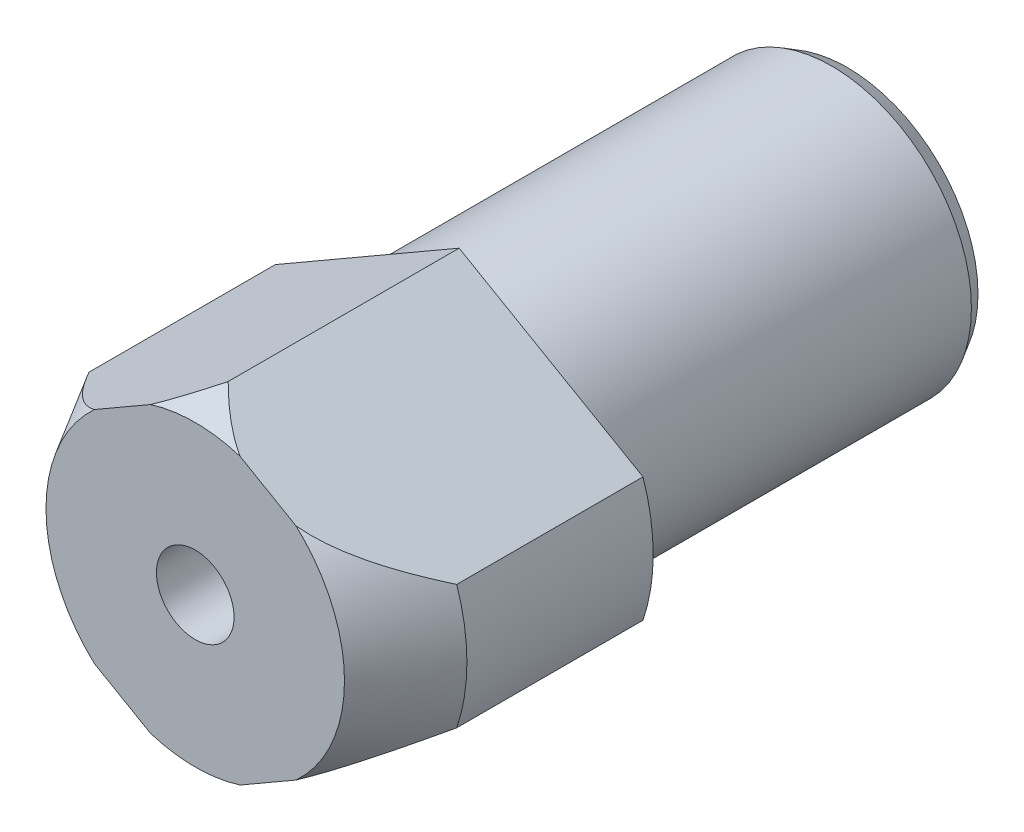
ISO-10303-21;
HEADER;
FILE_DESCRIPTION(('STEP AP214'),'2;1');
FILE_NAME('part.step','',(''),(''),'','','');
FILE_SCHEMA(('AUTOMOTIVE_DESIGN { 1 0 10303 214 1 1 1 1 }'));
ENDSEC;
DATA;
#1=APPLICATION_CONTEXT('core data for automotive mechanical design processes');
#2=APPLICATION_PROTOCOL_DEFINITION('international standard','automotive_design',2000,#1);
#3=PRODUCT_CONTEXT('',#1,'mechanical');
#4=PRODUCT('Part','Part','',(#3));
#5=PRODUCT_RELATED_PRODUCT_CATEGORY('part','',(#4));
#6=PRODUCT_DEFINITION_FORMATION('','',#4);
#7=PRODUCT_DEFINITION_CONTEXT('part definition',#1,'design');
#8=PRODUCT_DEFINITION('design','',#6,#7);
#9=PRODUCT_DEFINITION_SHAPE('','',#8);
#10=(LENGTH_UNIT() NAMED_UNIT(*) SI_UNIT(.MILLI.,.METRE.));
#11=(NAMED_UNIT(*) PLANE_ANGLE_UNIT() SI_UNIT($,.RADIAN.));
#12=(NAMED_UNIT(*) SI_UNIT($,.STERADIAN.) SOLID_ANGLE_UNIT());
#13=UNCERTAINTY_MEASURE_WITH_UNIT(LENGTH_MEASURE(1.E-05),#10,'distance_accuracy_value','');
#14=(GEOMETRIC_REPRESENTATION_CONTEXT(3) GLOBAL_UNCERTAINTY_ASSIGNED_CONTEXT((#13)) GLOBAL_UNIT_ASSIGNED_CONTEXT((#10,
#11,#12)) REPRESENTATION_CONTEXT('',''));
#15=CARTESIAN_POINT('',(0.,0.,0.));
#16=DIRECTION('',(0.,0.,1.));
#17=DIRECTION('',(1.,0.,0.));
#18=AXIS2_PLACEMENT_3D('',#15,#16,#17);
#19=CARTESIAN_POINT('',(0.,0.,12.));
#20=DIRECTION('',(0.,0.,-1.));
#21=DIRECTION('',(-1.,0.,0.));
#22=AXIS2_PLACEMENT_3D('',#19,#20,#21);
#23=CONICAL_SURFACE('',#22,12.5,0.523598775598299);
#24=CARTESIAN_POINT('',(6.49386498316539,7.08816246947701,17.0002));
#25=CARTESIAN_POINT('',(6.60533670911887,7.02380423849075,16.9519658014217));
#26=CARTESIAN_POINT('',(6.71554975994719,6.96017270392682,16.9000110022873));
#27=CARTESIAN_POINT('',(6.93338196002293,6.83440722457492,16.7894856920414));
#28=CARTESIAN_POINT('',(7.04100270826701,6.77227235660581,16.7309193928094));
#29=CARTESIAN_POINT('',(7.35935904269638,6.58846924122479,16.5468522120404));
#30=CARTESIAN_POINT('',(7.5663346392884,6.46897182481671,16.4126495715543));
#31=CARTESIAN_POINT('',(7.96833081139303,6.2368792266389,16.128105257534));
#32=CARTESIAN_POINT('',(8.16346186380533,6.12422026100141,15.9779679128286));
#33=CARTESIAN_POINT('',(8.54554525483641,5.90362431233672,15.6640833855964));
#34=CARTESIAN_POINT('',(8.73248971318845,5.79569187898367,15.5003235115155));
#35=CARTESIAN_POINT('',(9.1814473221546,5.53648608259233,15.0863652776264));
#36=CARTESIAN_POINT('',(9.43944719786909,5.38752978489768,14.830390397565));
#37=CARTESIAN_POINT('',(9.94306507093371,5.09676587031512,14.3027424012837));
#38=CARTESIAN_POINT('',(10.1886801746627,4.95495992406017,14.0310656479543));
#39=CARTESIAN_POINT('',(10.5517027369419,4.74536875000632,13.6123948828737));
#40=CARTESIAN_POINT('',(10.6728467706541,4.67542620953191,13.4696780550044));
#41=CARTESIAN_POINT('',(10.912788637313,4.53689570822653,13.181627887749));
#42=CARTESIAN_POINT('',(11.0315864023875,4.46830778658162,13.0362944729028));
#43=CARTESIAN_POINT('',(11.2669028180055,4.33244779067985,12.7435624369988));
#44=CARTESIAN_POINT('',(11.3834243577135,4.26517404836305,12.5961669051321));
#45=CARTESIAN_POINT('',(11.6145403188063,4.13173918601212,12.2994009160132));
#46=CARTESIAN_POINT('',(11.7291349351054,4.0655779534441,12.150030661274));
#47=CARTESIAN_POINT('',(11.8428706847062,3.99991258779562,11.9998));
#48=B_SPLINE_CURVE_WITH_KNOTS('',3,(#24,#25,#26,#27,#28,#29,#30,#31,#32,#33,#34,#35,#36,#37,#38,
#39,#40,#41,#42,#43,#44,#45,#46,#47),.UNSPECIFIED.,.F.,.F.,(4,2,2,2,2,2,2,2,2,2,2,4),(0.,
0.412226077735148,0.824191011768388,1.64536256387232,2.45704872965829,3.26949976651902,
4.44701188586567,5.62479786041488,6.224288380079,6.8237962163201,7.42248587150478,
8.02111459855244),.UNSPECIFIED.);
#49=CARTESIAN_POINT('',(6.49432714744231,7.08789563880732,17.));
#50=VERTEX_POINT('',#49);
#51=CARTESIAN_POINT('',(11.842719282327,4.,12.));
#52=VERTEX_POINT('',#51);
#53=EDGE_CURVE('E99',#50,#52,#48,.T.);
#54=ORIENTED_EDGE('',*,*,#53,.F.);
#55=CARTESIAN_POINT('',(0.,0.,17.));
#56=DIRECTION('',(0.,0.,1.));
#57=DIRECTION('',(1.,0.,0.));
#58=AXIS2_PLACEMENT_3D('',#55,#56,#57);
#59=CIRCLE('',#58,9.61324865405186);
#60=CARTESIAN_POINT('',(6.49432714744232,-7.08789563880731,17.));
#61=VERTEX_POINT('',#60);
#62=EDGE_CURVE('E224',#61,#50,#59,.T.);
#63=ORIENTED_EDGE('',*,*,#62,.F.);
#64=CARTESIAN_POINT('',(6.4938649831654,-7.088162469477,17.0002));
#65=CARTESIAN_POINT('',(6.60533670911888,-7.02380423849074,16.9519658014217));
#66=CARTESIAN_POINT('',(6.7155497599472,-6.96017270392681,16.9000110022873));
#67=CARTESIAN_POINT('',(6.93338196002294,-6.83440722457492,16.7894856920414));
#68=CARTESIAN_POINT('',(7.04100270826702,-6.77227235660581,16.7309193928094));
#69=CARTESIAN_POINT('',(7.35935904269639,-6.58846924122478,16.5468522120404));
#70=CARTESIAN_POINT('',(7.5663346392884,-6.4689718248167,16.4126495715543));
#71=CARTESIAN_POINT('',(7.96833081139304,-6.2368792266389,16.128105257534));
#72=CARTESIAN_POINT('',(8.16346186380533,-6.12422026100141,15.9779679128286));
#73=CARTESIAN_POINT('',(8.54554525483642,-5.90362431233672,15.6640833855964));
#74=CARTESIAN_POINT('',(8.73248971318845,-5.79569187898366,15.5003235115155));
#75=CARTESIAN_POINT('',(9.1814473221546,-5.53648608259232,15.0863652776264));
#76=CARTESIAN_POINT('',(9.43944719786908,-5.38752978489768,14.830390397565));
#77=CARTESIAN_POINT('',(9.94306507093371,-5.09676587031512,14.3027424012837));
#78=CARTESIAN_POINT('',(10.1886801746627,-4.95495992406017,14.0310656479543));
#79=CARTESIAN_POINT('',(10.5517027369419,-4.74536875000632,13.6123948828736));
#80=CARTESIAN_POINT('',(10.6728467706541,-4.67542620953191,13.4696780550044));
#81=CARTESIAN_POINT('',(10.912788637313,-4.53689570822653,13.181627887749));
#82=CARTESIAN_POINT('',(11.0315864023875,-4.46830778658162,13.0362944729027));
#83=CARTESIAN_POINT('',(11.2669028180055,-4.33244779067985,12.7435624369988));
#84=CARTESIAN_POINT('',(11.3834243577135,-4.26517404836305,12.5961669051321));
#85=CARTESIAN_POINT('',(11.6145403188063,-4.13173918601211,12.2994009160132));
#86=CARTESIAN_POINT('',(11.7291349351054,-4.0655779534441,12.150030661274));
#87=CARTESIAN_POINT('',(11.8428706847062,-3.99991258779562,11.9998));
#88=B_SPLINE_CURVE_WITH_KNOTS('',3,(#64,#65,#66,#67,#68,#69,#70,#71,#72,#73,#74,#75,#76,#77,#78,
#79,#80,#81,#82,#83,#84,#85,#86,#87),.UNSPECIFIED.,.F.,.F.,(4,2,2,2,2,2,2,2,2,2,2,4),(0.,
0.412226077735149,0.824191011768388,1.64536256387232,2.45704872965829,3.26949976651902,
4.44701188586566,5.62479786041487,6.224288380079,6.82379621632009,7.42248587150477,
8.02111459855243),.UNSPECIFIED.);
#89=CARTESIAN_POINT('',(11.842719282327,-4.,12.));
#90=VERTEX_POINT('',#89);
#91=EDGE_CURVE('E237',#61,#90,#88,.T.);
#92=ORIENTED_EDGE('',*,*,#91,.T.);
#93=CARTESIAN_POINT('',(0.,0.,12.));
#94=DIRECTION('',(0.,0.,1.));
#95=DIRECTION('',(1.,0.,0.));
#96=AXIS2_PLACEMENT_3D('',#93,#94,#95);
#97=CIRCLE('',#96,12.5);
#98=EDGE_CURVE('E124',#90,#52,#97,.T.);
#99=ORIENTED_EDGE('',*,*,#98,.T.);
#100=EDGE_LOOP('',(#54,#63,#92,#99));
#101=FACE_BOUND('',#100,.T.);
#102=ADVANCED_FACE('F14',(#101),#23,.T.);
#103=CARTESIAN_POINT('',(-0.000200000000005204,10.8375126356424,14.8795125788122));
#104=CARTESIAN_POINT('',(0.10853087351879,10.7747368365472,14.9882268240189));
#105=CARTESIAN_POINT('',(0.218469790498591,10.7112635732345,15.0953542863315));
#106=CARTESIAN_POINT('',(0.441035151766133,10.5827654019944,15.3058908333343));
#107=CARTESIAN_POINT('',(0.553662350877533,10.5177400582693,15.4092988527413));
#108=CARTESIAN_POINT('',(0.780942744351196,10.3865196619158,15.6110158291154));
#109=CARTESIAN_POINT('',(0.895573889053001,10.3203373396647,15.7093577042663));
#110=CARTESIAN_POINT('',(1.12790669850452,10.1861999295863,15.9010504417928));
#111=CARTESIAN_POINT('',(1.24560839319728,10.1182448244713,15.9944012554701));
#112=CARTESIAN_POINT('',(1.60419684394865,9.91121368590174,16.2661456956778));
#113=CARTESIAN_POINT('',(1.85018375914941,9.76919307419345,16.4358843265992));
#114=CARTESIAN_POINT('',(2.23101578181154,9.54931960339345,16.6670579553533));
#115=CARTESIAN_POINT('',(2.36044638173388,9.47459281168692,16.740442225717));
#116=CARTESIAN_POINT('',(2.62315549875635,9.32291763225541,16.8777749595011));
#117=CARTESIAN_POINT('',(2.75643779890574,9.24596706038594,16.9417137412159));
#118=CARTESIAN_POINT('',(2.89159627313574,9.16793327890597,17.0002));
#119=B_SPLINE_CURVE_WITH_KNOTS('',3,(#103,#104,#105,#106,#107,#108,#109,#110,#111,#112,#113,
#114,#115,#116,#117,#118),.UNSPECIFIED.,.F.,.F.,(4,2,2,2,2,2,2,4),(0.,0.498243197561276,
0.996627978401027,1.49120549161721,1.9857878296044,2.97663541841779,3.47584274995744,
3.97555827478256),.UNSPECIFIED.);
#120=CARTESIAN_POINT('',(0.,10.8373971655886,14.8797125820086));
#121=VERTEX_POINT('',#120);
#122=CARTESIAN_POINT('',(2.89113410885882,9.16820010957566,17.));
#123=VERTEX_POINT('',#122);
#124=EDGE_CURVE('E229',#121,#123,#119,.T.);
#125=ORIENTED_EDGE('',*,*,#124,.F.);
#126=CARTESIAN_POINT('',(0.000199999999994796,10.8375126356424,14.8795125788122));
#127=CARTESIAN_POINT('',(-0.1085308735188,10.7747368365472,14.9882268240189));
#128=CARTESIAN_POINT('',(-0.218469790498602,10.7112635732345,15.0953542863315));
#129=CARTESIAN_POINT('',(-0.441035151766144,10.5827654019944,15.3058908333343));
#130=CARTESIAN_POINT('',(-0.553662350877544,10.5177400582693,15.4092988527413));
#131=CARTESIAN_POINT('',(-0.780942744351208,10.3865196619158,15.6110158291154));
#132=CARTESIAN_POINT('',(-0.895573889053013,10.3203373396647,15.7093577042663));
#133=CARTESIAN_POINT('',(-1.12790669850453,10.1861999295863,15.9010504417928));
#134=CARTESIAN_POINT('',(-1.24560839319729,10.1182448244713,15.9944012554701));
#135=CARTESIAN_POINT('',(-1.60419684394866,9.91121368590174,16.2661456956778));
#136=CARTESIAN_POINT('',(-1.85018375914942,9.76919307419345,16.4358843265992));
#137=CARTESIAN_POINT('',(-2.23101578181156,9.54931960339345,16.6670579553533));
#138=CARTESIAN_POINT('',(-2.36044638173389,9.47459281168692,16.740442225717));
#139=CARTESIAN_POINT('',(-2.62315549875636,9.32291763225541,16.8777749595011));
#140=CARTESIAN_POINT('',(-2.75643779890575,9.24596706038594,16.9417137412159));
#141=CARTESIAN_POINT('',(-2.89159627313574,9.16793327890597,17.0002));
#142=B_SPLINE_CURVE_WITH_KNOTS('',3,(#126,#127,#128,#129,#130,#131,#132,#133,#134,#135,#136,
#137,#138,#139,#140,#141),.UNSPECIFIED.,.F.,.F.,(4,2,2,2,2,2,2,4),(0.,0.498243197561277,
0.996627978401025,1.49120549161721,1.9857878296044,2.97663541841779,3.47584274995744,
3.97555827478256),.UNSPECIFIED.);
#143=CARTESIAN_POINT('',(-2.89113410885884,9.16820010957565,17.));
#144=VERTEX_POINT('',#143);
#145=EDGE_CURVE('E104',#121,#144,#142,.T.);
#146=ORIENTED_EDGE('',*,*,#145,.T.);
#147=EDGE_CURVE('E221',#123,#144,#59,.T.);
#148=ORIENTED_EDGE('',*,*,#147,.F.);
#149=EDGE_LOOP('',(#125,#146,#148));
#150=FACE_BOUND('',#149,.T.);
#151=ADVANCED_FACE('F151',(#150),#23,.T.);
#152=CARTESIAN_POINT('',(9.61324865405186,0.,17.));
#153=DIRECTION('',(0.,0.,-1.));
#154=DIRECTION('',(-1.,0.,0.));
#155=AXIS2_PLACEMENT_3D('',#152,#153,#154);
#156=PLANE('',#155);
#157=CARTESIAN_POINT('',(0.,0.,17.));
#158=DIRECTION('',(0.,0.,1.));
#159=DIRECTION('',(1.,0.,0.));
#160=AXIS2_PLACEMENT_3D('',#157,#158,#159);
#161=CIRCLE('',#160,2.5);
#162=CARTESIAN_POINT('',(2.5,0.,17.));
#163=VERTEX_POINT('',#162);
#164=EDGE_CURVE('E214',#163,#163,#161,.T.);
#165=ORIENTED_EDGE('',*,*,#164,.F.);
#166=EDGE_LOOP('',(#165));
#167=FACE_BOUND('',#166,.T.);
#168=DIRECTION('',(-0.866025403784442,0.5,0.));
#169=VECTOR('',#168,1.);
#170=CARTESIAN_POINT('',(11.842719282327,4.,17.));
#171=LINE('',#170,#169);
#172=EDGE_CURVE('E218',#50,#123,#171,.T.);
#173=ORIENTED_EDGE('',*,*,#172,.T.);
#174=ORIENTED_EDGE('',*,*,#147,.T.);
#175=DIRECTION('',(0.866025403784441,0.5,0.));
#176=VECTOR('',#175,1.);
#177=CARTESIAN_POINT('',(-11.842719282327,4.,17.));
#178=LINE('',#177,#176);
#179=CARTESIAN_POINT('',(-6.49432714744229,7.08789563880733,17.));
#180=VERTEX_POINT('',#179);
#181=EDGE_CURVE('E113',#180,#144,#178,.T.);
#182=ORIENTED_EDGE('',*,*,#181,.F.);
#183=CARTESIAN_POINT('',(-6.4943271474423,-7.08789563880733,17.));
#184=VERTEX_POINT('',#183);
#185=EDGE_CURVE('E230',#180,#184,#59,.T.);
#186=ORIENTED_EDGE('',*,*,#185,.T.);
#187=DIRECTION('',(0.866025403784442,-0.5,0.));
#188=VECTOR('',#187,1.);
#189=CARTESIAN_POINT('',(-11.842719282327,-4.,17.));
#190=LINE('',#189,#188);
#191=CARTESIAN_POINT('',(-2.89113410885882,-9.16820010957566,17.));
#192=VERTEX_POINT('',#191);
#193=EDGE_CURVE('E251',#184,#192,#190,.T.);
#194=ORIENTED_EDGE('',*,*,#193,.T.);
#195=CARTESIAN_POINT('',(2.89113410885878,-9.16820010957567,17.));
#196=VERTEX_POINT('',#195);
#197=EDGE_CURVE('E179',#192,#196,#59,.T.);
#198=ORIENTED_EDGE('',*,*,#197,.T.);
#199=DIRECTION('',(-0.866025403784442,-0.5,0.));
#200=VECTOR('',#199,1.);
#201=CARTESIAN_POINT('',(11.842719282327,-4.,17.));
#202=LINE('',#201,#200);
#203=EDGE_CURVE('E249',#61,#196,#202,.T.);
#204=ORIENTED_EDGE('',*,*,#203,.F.);
#205=ORIENTED_EDGE('',*,*,#62,.T.);
#206=EDGE_LOOP('',(#173,#174,#182,#186,#194,#198,#204,#205));
#207=FACE_BOUND('',#206,.T.);
#208=ADVANCED_FACE('F157',(#167,#207),#156,.F.);
#209=CARTESIAN_POINT('',(9.,0.,0.));
#210=DIRECTION('',(0.,0.,1.));
#211=DIRECTION('',(1.,0.,0.));
#212=AXIS2_PLACEMENT_3D('',#209,#210,#211);
#213=PLANE('',#212);
#214=CARTESIAN_POINT('',(0.,0.,0.));
#215=DIRECTION('',(0.,0.,1.));
#216=DIRECTION('',(1.,0.,0.));
#217=AXIS2_PLACEMENT_3D('',#214,#215,#216);
#218=CIRCLE('',#217,9.);
#219=CARTESIAN_POINT('',(9.,0.,0.));
#220=VERTEX_POINT('',#219);
#221=EDGE_CURVE('E118',#220,#220,#218,.T.);
#222=ORIENTED_EDGE('',*,*,#221,.T.);
#223=EDGE_LOOP('',(#222));
#224=FACE_BOUND('',#223,.T.);
#225=DIRECTION('',(-0.866025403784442,0.5,0.));
#226=VECTOR('',#225,1.);
#227=CARTESIAN_POINT('',(11.842719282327,4.,0.));
#228=LINE('',#227,#226);
#229=CARTESIAN_POINT('',(11.842719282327,4.,0.));
#230=VERTEX_POINT('',#229);
#231=CARTESIAN_POINT('',(0.,10.8373971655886,0.));
#232=VERTEX_POINT('',#231);
#233=EDGE_CURVE('E97',#230,#232,#228,.T.);
#234=ORIENTED_EDGE('',*,*,#233,.F.);
#235=CARTESIAN_POINT('',(0.,0.,0.));
#236=DIRECTION('',(0.,0.,1.));
#237=DIRECTION('',(1.,0.,0.));
#238=AXIS2_PLACEMENT_3D('',#235,#236,#237);
#239=CIRCLE('',#238,12.5);
#240=CARTESIAN_POINT('',(11.842719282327,-4.,0.));
#241=VERTEX_POINT('',#240);
#242=EDGE_CURVE('E111',#241,#230,#239,.T.);
#243=ORIENTED_EDGE('',*,*,#242,.F.);
#244=DIRECTION('',(-0.866025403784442,-0.5,0.));
#245=VECTOR('',#244,1.);
#246=CARTESIAN_POINT('',(11.842719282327,-4.,0.));
#247=LINE('',#246,#245);
#248=CARTESIAN_POINT('',(0.,-10.8373971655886,0.));
#249=VERTEX_POINT('',#248);
#250=EDGE_CURVE('E254',#241,#249,#247,.T.);
#251=ORIENTED_EDGE('',*,*,#250,.T.);
#252=DIRECTION('',(0.866025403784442,-0.5,0.));
#253=VECTOR('',#252,1.);
#254=CARTESIAN_POINT('',(-11.842719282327,-4.,0.));
#255=LINE('',#254,#253);
#256=CARTESIAN_POINT('',(-11.842719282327,-4.,0.));
#257=VERTEX_POINT('',#256);
#258=EDGE_CURVE('E250',#257,#249,#255,.T.);
#259=ORIENTED_EDGE('',*,*,#258,.F.);
#260=CARTESIAN_POINT('',(-11.842719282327,4.,0.));
#261=VERTEX_POINT('',#260);
#262=EDGE_CURVE('E119',#261,#257,#239,.T.);
#263=ORIENTED_EDGE('',*,*,#262,.F.);
#264=DIRECTION('',(0.866025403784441,0.5,0.));
#265=VECTOR('',#264,1.);
#266=CARTESIAN_POINT('',(-11.842719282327,4.,0.));
#267=LINE('',#266,#265);
#268=EDGE_CURVE('E29',#261,#232,#267,.T.);
#269=ORIENTED_EDGE('',*,*,#268,.T.);
#270=EDGE_LOOP('',(#234,#243,#251,#259,#263,#269));
#271=FACE_BOUND('',#270,.T.);
#272=ADVANCED_FACE('F109',(#224,#271),#213,.F.);
#273=CARTESIAN_POINT('',(0.,0.,30.));
#274=DIRECTION('',(0.,0.,1.));
#275=DIRECTION('',(1.,0.,0.));
#276=AXIS2_PLACEMENT_3D('',#273,#274,#275);
#277=CYLINDRICAL_SURFACE('',#276,12.5);
#278=DIRECTION('',(0.,0.,1.));
#279=VECTOR('',#278,1.);
#280=CARTESIAN_POINT('',(11.842719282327,4.,0.));
#281=LINE('',#280,#279);
#282=EDGE_CURVE('E93',#230,#52,#281,.T.);
#283=ORIENTED_EDGE('',*,*,#282,.T.);
#284=ORIENTED_EDGE('',*,*,#98,.F.);
#285=DIRECTION('',(0.,0.,1.));
#286=VECTOR('',#285,1.);
#287=CARTESIAN_POINT('',(11.842719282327,-4.,0.));
#288=LINE('',#287,#286);
#289=EDGE_CURVE('E117',#241,#90,#288,.T.);
#290=ORIENTED_EDGE('',*,*,#289,.F.);
#291=ORIENTED_EDGE('',*,*,#242,.T.);
#292=EDGE_LOOP('',(#283,#284,#290,#291));
#293=FACE_BOUND('',#292,.T.);
#294=ADVANCED_FACE('F116',(#293),#277,.T.);
#295=ORIENTED_EDGE('',*,*,#185,.F.);
#296=CARTESIAN_POINT('',(-6.49386498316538,7.08816246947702,17.0002));
#297=CARTESIAN_POINT('',(-6.60533670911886,7.02380423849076,16.9519658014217));
#298=CARTESIAN_POINT('',(-6.71554975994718,6.96017270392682,16.9000110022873));
#299=CARTESIAN_POINT('',(-6.93338196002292,6.83440722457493,16.7894856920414));
#300=CARTESIAN_POINT('',(-7.04100270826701,6.77227235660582,16.7309193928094));
#301=CARTESIAN_POINT('',(-7.35935904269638,6.5884692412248,16.5468522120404));
#302=CARTESIAN_POINT('',(-7.56633463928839,6.46897182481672,16.4126495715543));
#303=CARTESIAN_POINT('',(-7.96833081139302,6.23687922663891,16.128105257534));
#304=CARTESIAN_POINT('',(-8.16346186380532,6.12422026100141,15.9779679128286));
#305=CARTESIAN_POINT('',(-8.54554525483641,5.90362431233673,15.6640833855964));
#306=CARTESIAN_POINT('',(-8.73248971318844,5.79569187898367,15.5003235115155));
#307=CARTESIAN_POINT('',(-9.18144732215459,5.53648608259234,15.0863652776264));
#308=CARTESIAN_POINT('',(-9.43944719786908,5.38752978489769,14.830390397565));
#309=CARTESIAN_POINT('',(-9.94306507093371,5.09676587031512,14.3027424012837));
#310=CARTESIAN_POINT('',(-10.1886801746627,4.95495992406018,14.0310656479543));
#311=CARTESIAN_POINT('',(-10.5517027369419,4.74536875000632,13.6123948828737));
#312=CARTESIAN_POINT('',(-10.6728467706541,4.67542620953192,13.4696780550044));
#313=CARTESIAN_POINT('',(-10.912788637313,4.53689570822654,13.181627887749));
#314=CARTESIAN_POINT('',(-11.0315864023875,4.46830778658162,13.0362944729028));
#315=CARTESIAN_POINT('',(-11.2669028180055,4.33244779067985,12.7435624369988));
#316=CARTESIAN_POINT('',(-11.3834243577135,4.26517404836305,12.5961669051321));
#317=CARTESIAN_POINT('',(-11.6145403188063,4.13173918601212,12.2994009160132));
#318=CARTESIAN_POINT('',(-11.7291349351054,4.0655779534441,12.150030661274));
#319=CARTESIAN_POINT('',(-11.8428706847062,3.99991258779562,11.9998));
#320=B_SPLINE_CURVE_WITH_KNOTS('',3,(#296,#297,#298,#299,#300,#301,#302,#303,#304,#305,#306,
#307,#308,#309,#310,#311,#312,#313,#314,#315,#316,#317,#318,#319),.UNSPECIFIED.,.F.,.F.,(4,2,2,
2,2,2,2,2,2,2,2,4),(0.,0.41222607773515,0.824191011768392,1.64536256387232,2.4570487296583,
3.26949976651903,4.44701188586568,5.62479786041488,6.22428838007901,6.82379621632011,
7.42248587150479,8.02111459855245),.UNSPECIFIED.);
#321=CARTESIAN_POINT('',(-11.842719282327,4.,12.));
#322=VERTEX_POINT('',#321);
#323=EDGE_CURVE('E270',#180,#322,#320,.T.);
#324=ORIENTED_EDGE('',*,*,#323,.T.);
#325=CARTESIAN_POINT('',(-11.842719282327,-4.,12.));
#326=VERTEX_POINT('',#325);
#327=EDGE_CURVE('E232',#322,#326,#97,.T.);
#328=ORIENTED_EDGE('',*,*,#327,.T.);
#329=CARTESIAN_POINT('',(-6.49386498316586,-7.08816246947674,17.0002));
#330=CARTESIAN_POINT('',(-6.6053367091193,-7.0238042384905,16.9519658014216));
#331=CARTESIAN_POINT('',(-6.7155497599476,-6.96017270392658,16.9000110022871));
#332=CARTESIAN_POINT('',(-6.93338196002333,-6.83440722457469,16.7894856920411));
#333=CARTESIAN_POINT('',(-7.04100270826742,-6.77227235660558,16.7309193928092));
#334=CARTESIAN_POINT('',(-7.35935904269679,-6.58846924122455,16.5468522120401));
#335=CARTESIAN_POINT('',(-7.5663346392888,-6.46897182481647,16.412649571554));
#336=CARTESIAN_POINT('',(-7.96833081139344,-6.23687922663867,16.1281052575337));
#337=CARTESIAN_POINT('',(-8.16346186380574,-6.12422026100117,15.9779679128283));
#338=CARTESIAN_POINT('',(-8.54554525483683,-5.90362431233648,15.664083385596));
#339=CARTESIAN_POINT('',(-8.73248971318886,-5.79569187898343,15.5003235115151));
#340=CARTESIAN_POINT('',(-9.18144732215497,-5.53648608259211,15.0863652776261));
#341=CARTESIAN_POINT('',(-9.43944719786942,-5.38752978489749,14.8303903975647));
#342=CARTESIAN_POINT('',(-9.94306507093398,-5.09676587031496,14.3027424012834));
#343=CARTESIAN_POINT('',(-10.1886801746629,-4.95495992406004,14.031065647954));
#344=CARTESIAN_POINT('',(-10.5517027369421,-4.74536875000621,13.6123948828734));
#345=CARTESIAN_POINT('',(-10.6728467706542,-4.67542620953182,13.4696780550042));
#346=CARTESIAN_POINT('',(-10.9127886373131,-4.53689570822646,13.1816278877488));
#347=CARTESIAN_POINT('',(-11.0315864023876,-4.46830778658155,13.0362944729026));
#348=CARTESIAN_POINT('',(-11.2669028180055,-4.33244779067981,12.7435624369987));
#349=CARTESIAN_POINT('',(-11.3834243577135,-4.26517404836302,12.596166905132));
#350=CARTESIAN_POINT('',(-11.6145403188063,-4.1317391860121,12.2994009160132));
#351=CARTESIAN_POINT('',(-11.7291349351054,-4.06557795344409,12.150030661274));
#352=CARTESIAN_POINT('',(-11.8428706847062,-3.99991258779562,11.9998));
#353=B_SPLINE_CURVE_WITH_KNOTS('',3,(#329,#330,#331,#332,#333,#334,#335,#336,#337,#338,#339,
#340,#341,#342,#343,#344,#345,#346,#347,#348,#349,#350,#351,#352),.UNSPECIFIED.,.F.,.F.,(4,2,2,
2,2,2,2,2,2,2,2,4),(0.,0.412226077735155,0.824191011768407,1.64536256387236,2.45704872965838,
3.26949976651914,4.44701188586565,5.62479786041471,6.22428838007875,6.82379621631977,
7.42248587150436,8.02111459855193),.UNSPECIFIED.);
#354=EDGE_CURVE('E180',#184,#326,#353,.T.);
#355=ORIENTED_EDGE('',*,*,#354,.F.);
#356=EDGE_LOOP('',(#295,#324,#328,#355));
#357=FACE_BOUND('',#356,.T.);
#358=ADVANCED_FACE('F143',(#357),#23,.T.);
#359=CARTESIAN_POINT('',(0.,0.,-21.));
#360=DIRECTION('',(0.,0.,1.));
#361=DIRECTION('',(1.,0.,0.));
#362=AXIS2_PLACEMENT_3D('',#359,#360,#361);
#363=PLANE('',#362);
#364=CARTESIAN_POINT('',(0.,0.,-21.));
#365=DIRECTION('',(0.,0.,1.));
#366=DIRECTION('',(1.,0.,0.));
#367=AXIS2_PLACEMENT_3D('',#364,#365,#366);
#368=CIRCLE('',#367,1.);
#369=CARTESIAN_POINT('',(1.,0.,-21.));
#370=VERTEX_POINT('',#369);
#371=EDGE_CURVE('E9',#370,#370,#368,.T.);
#372=ORIENTED_EDGE('',*,*,#371,.F.);
#373=EDGE_LOOP('',(#372));
#374=FACE_BOUND('',#373,.T.);
#375=ADVANCED_FACE('F16',(#374),#363,.F.);
#376=CARTESIAN_POINT('',(0.,0.,30.));
#377=DIRECTION('',(0.,0.,1.));
#378=DIRECTION('',(1.,0.,0.));
#379=AXIS2_PLACEMENT_3D('',#376,#377,#378);
#380=CYLINDRICAL_SURFACE('',#379,1.);
#381=CARTESIAN_POINT('',(0.,0.,-25.));
#382=DIRECTION('',(0.,0.,1.));
#383=DIRECTION('',(1.,0.,0.));
#384=AXIS2_PLACEMENT_3D('',#381,#382,#383);
#385=CIRCLE('',#384,1.);
#386=CARTESIAN_POINT('',(1.,0.,-25.));
#387=VERTEX_POINT('',#386);
#388=EDGE_CURVE('E22',#387,#387,#385,.T.);
#389=ORIENTED_EDGE('',*,*,#388,.F.);
#390=EDGE_LOOP('',(#389));
#391=FACE_BOUND('',#390,.T.);
#392=ORIENTED_EDGE('',*,*,#371,.T.);
#393=EDGE_LOOP('',(#392));
#394=FACE_BOUND('',#393,.T.);
#395=ADVANCED_FACE('F137',(#391,#394),#380,.F.);
#396=CARTESIAN_POINT('',(1.,0.,-25.));
#397=DIRECTION('',(0.,0.,1.));
#398=DIRECTION('',(1.,0.,0.));
#399=AXIS2_PLACEMENT_3D('',#396,#397,#398);
#400=PLANE('',#399);
#401=CARTESIAN_POINT('',(0.,0.,-25.));
#402=DIRECTION('',(0.,0.,1.));
#403=DIRECTION('',(1.,0.,0.));
#404=AXIS2_PLACEMENT_3D('',#401,#402,#403);
#405=CIRCLE('',#404,8.42264973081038);
#406=CARTESIAN_POINT('',(8.42264973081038,0.,-25.));
#407=VERTEX_POINT('',#406);
#408=EDGE_CURVE('E130',#407,#407,#405,.T.);
#409=ORIENTED_EDGE('',*,*,#408,.F.);
#410=EDGE_LOOP('',(#409));
#411=FACE_BOUND('',#410,.T.);
#412=ORIENTED_EDGE('',*,*,#388,.T.);
#413=EDGE_LOOP('',(#412));
#414=FACE_BOUND('',#413,.T.);
#415=ADVANCED_FACE('F135',(#411,#414),#400,.F.);
#416=CARTESIAN_POINT('',(0.,0.,-24.));
#417=DIRECTION('',(0.,0.,1.));
#418=DIRECTION('',(1.,0.,0.));
#419=AXIS2_PLACEMENT_3D('',#416,#417,#418);
#420=CONICAL_SURFACE('',#419,9.,0.523598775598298);
#421=ORIENTED_EDGE('',*,*,#408,.T.);
#422=EDGE_LOOP('',(#421));
#423=FACE_BOUND('',#422,.T.);
#424=CARTESIAN_POINT('',(0.,0.,-24.));
#425=DIRECTION('',(0.,0.,1.));
#426=DIRECTION('',(1.,0.,0.));
#427=AXIS2_PLACEMENT_3D('',#424,#425,#426);
#428=CIRCLE('',#427,9.);
#429=CARTESIAN_POINT('',(9.,0.,-24.));
#430=VERTEX_POINT('',#429);
#431=EDGE_CURVE('E122',#430,#430,#428,.T.);
#432=ORIENTED_EDGE('',*,*,#431,.F.);
#433=EDGE_LOOP('',(#432));
#434=FACE_BOUND('',#433,.T.);
#435=ADVANCED_FACE('F335',(#423,#434),#420,.T.);
#436=CARTESIAN_POINT('',(0.,0.,30.));
#437=DIRECTION('',(0.,0.,1.));
#438=DIRECTION('',(1.,0.,0.));
#439=AXIS2_PLACEMENT_3D('',#436,#437,#438);
#440=CYLINDRICAL_SURFACE('',#439,9.);
#441=ORIENTED_EDGE('',*,*,#221,.F.);
#442=EDGE_LOOP('',(#441));
#443=FACE_BOUND('',#442,.T.);
#444=ORIENTED_EDGE('',*,*,#431,.T.);
#445=EDGE_LOOP('',(#444));
#446=FACE_BOUND('',#445,.T.);
#447=ADVANCED_FACE('F173',(#443,#446),#440,.T.);
#448=ORIENTED_EDGE('',*,*,#327,.F.);
#449=DIRECTION('',(0.,0.,1.));
#450=VECTOR('',#449,1.);
#451=CARTESIAN_POINT('',(-11.842719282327,4.,0.));
#452=LINE('',#451,#450);
#453=EDGE_CURVE('E274',#261,#322,#452,.T.);
#454=ORIENTED_EDGE('',*,*,#453,.F.);
#455=ORIENTED_EDGE('',*,*,#262,.T.);
#456=DIRECTION('',(0.,0.,1.));
#457=VECTOR('',#456,1.);
#458=CARTESIAN_POINT('',(-11.842719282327,-4.,0.));
#459=LINE('',#458,#457);
#460=EDGE_CURVE('E184',#257,#326,#459,.T.);
#461=ORIENTED_EDGE('',*,*,#460,.T.);
#462=EDGE_LOOP('',(#448,#454,#455,#461));
#463=FACE_BOUND('',#462,.T.);
#464=ADVANCED_FACE('F164',(#463),#277,.T.);
#465=CARTESIAN_POINT('',(0.000199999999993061,-10.8375126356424,14.8795125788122));
#466=CARTESIAN_POINT('',(-0.108530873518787,-10.7747368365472,14.9882268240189));
#467=CARTESIAN_POINT('',(-0.218469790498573,-10.7112635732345,15.0953542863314));
#468=CARTESIAN_POINT('',(-0.441035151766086,-10.5827654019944,15.3058908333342));
#469=CARTESIAN_POINT('',(-0.553662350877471,-10.5177400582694,15.4092988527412));
#470=CARTESIAN_POINT('',(-0.780942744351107,-10.3865196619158,15.6110158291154));
#471=CARTESIAN_POINT('',(-0.895573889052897,-10.3203373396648,15.7093577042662));
#472=CARTESIAN_POINT('',(-1.12790669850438,-10.1861999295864,15.9010504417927));
#473=CARTESIAN_POINT('',(-1.24560839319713,-10.1182448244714,15.99440125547));
#474=CARTESIAN_POINT('',(-1.60419684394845,-9.91121368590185,16.2661456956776));
#475=CARTESIAN_POINT('',(-1.85018375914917,-9.76919307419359,16.435884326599));
#476=CARTESIAN_POINT('',(-2.23101578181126,-9.54931960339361,16.6670579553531));
#477=CARTESIAN_POINT('',(-2.36044638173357,-9.47459281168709,16.7404422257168));
#478=CARTESIAN_POINT('',(-2.62315549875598,-9.32291763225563,16.877774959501));
#479=CARTESIAN_POINT('',(-2.75643779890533,-9.24596706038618,16.9417137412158));
#480=CARTESIAN_POINT('',(-2.89159627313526,-9.16793327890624,17.0002));
#481=B_SPLINE_CURVE_WITH_KNOTS('',3,(#465,#466,#467,#468,#469,#470,#471,#472,#473,#474,#475,
#476,#477,#478,#479,#480),.UNSPECIFIED.,.F.,.F.,(4,2,2,2,2,2,2,4),(0.,0.498243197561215,
0.996627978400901,1.49120549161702,1.98578782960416,2.97663541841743,3.475842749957,
3.97555827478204),.UNSPECIFIED.);
#482=CARTESIAN_POINT('',(0.,-10.8373971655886,14.8797125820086));
#483=VERTEX_POINT('',#482);
#484=EDGE_CURVE('E37',#483,#192,#481,.T.);
#485=ORIENTED_EDGE('',*,*,#484,.F.);
#486=CARTESIAN_POINT('',(-0.000200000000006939,-10.8375126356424,14.8795125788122));
#487=CARTESIAN_POINT('',(0.108530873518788,-10.7747368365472,14.988226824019));
#488=CARTESIAN_POINT('',(0.21846979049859,-10.7112635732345,15.0953542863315));
#489=CARTESIAN_POINT('',(0.441035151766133,-10.5827654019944,15.3058908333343));
#490=CARTESIAN_POINT('',(0.553662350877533,-10.5177400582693,15.4092988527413));
#491=CARTESIAN_POINT('',(0.780942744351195,-10.3865196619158,15.6110158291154));
#492=CARTESIAN_POINT('',(0.895573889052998,-10.3203373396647,15.7093577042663));
#493=CARTESIAN_POINT('',(1.12790669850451,-10.1861999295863,15.9010504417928));
#494=CARTESIAN_POINT('',(1.24560839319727,-10.1182448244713,15.9944012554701));
#495=CARTESIAN_POINT('',(1.60419684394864,-9.91121368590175,16.2661456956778));
#496=CARTESIAN_POINT('',(1.8501837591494,-9.76919307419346,16.4358843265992));
#497=CARTESIAN_POINT('',(2.23101578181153,-9.54931960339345,16.6670579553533));
#498=CARTESIAN_POINT('',(2.36044638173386,-9.47459281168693,16.740442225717));
#499=CARTESIAN_POINT('',(2.62315549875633,-9.32291763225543,16.8777749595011));
#500=CARTESIAN_POINT('',(2.75643779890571,-9.24596706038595,16.9417137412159));
#501=CARTESIAN_POINT('',(2.8915962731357,-9.16793327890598,17.0002));
#502=B_SPLINE_CURVE_WITH_KNOTS('',3,(#486,#487,#488,#489,#490,#491,#492,#493,#494,#495,#496,
#497,#498,#499,#500,#501),.UNSPECIFIED.,.F.,.F.,(4,2,2,2,2,2,2,4),(0.,0.498243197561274,
0.996627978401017,1.49120549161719,1.98578782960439,2.97663541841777,3.47584274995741,
3.97555827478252),.UNSPECIFIED.);
#503=EDGE_CURVE('E177',#483,#196,#502,.T.);
#504=ORIENTED_EDGE('',*,*,#503,.T.);
#505=ORIENTED_EDGE('',*,*,#197,.F.);
#506=EDGE_LOOP('',(#485,#504,#505));
#507=FACE_BOUND('',#506,.T.);
#508=ADVANCED_FACE('F150',(#507),#23,.T.);
#509=CARTESIAN_POINT('',(0.,0.,30.));
#510=DIRECTION('',(0.,0.,1.));
#511=DIRECTION('',(1.,0.,0.));
#512=AXIS2_PLACEMENT_3D('',#509,#510,#511);
#513=CYLINDRICAL_SURFACE('',#512,2.5);
#514=CARTESIAN_POINT('',(0.,0.,9.));
#515=DIRECTION('',(0.,0.,1.));
#516=DIRECTION('',(1.,0.,0.));
#517=AXIS2_PLACEMENT_3D('',#514,#515,#516);
#518=CIRCLE('',#517,2.5);
#519=CARTESIAN_POINT('',(2.5,0.,9.));
#520=VERTEX_POINT('',#519);
#521=EDGE_CURVE('E225',#520,#520,#518,.T.);
#522=ORIENTED_EDGE('',*,*,#521,.F.);
#523=EDGE_LOOP('',(#522));
#524=FACE_BOUND('',#523,.T.);
#525=ORIENTED_EDGE('',*,*,#164,.T.);
#526=EDGE_LOOP('',(#525));
#527=FACE_BOUND('',#526,.T.);
#528=ADVANCED_FACE('F163',(#524,#527),#513,.F.);
#529=CARTESIAN_POINT('',(11.842719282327,-4.,0.));
#530=DIRECTION('',(-0.5,0.866025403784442,0.));
#531=DIRECTION('',(-0.866025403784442,-0.5,0.));
#532=AXIS2_PLACEMENT_3D('',#529,#530,#531);
#533=PLANE('',#532);
#534=ORIENTED_EDGE('',*,*,#203,.T.);
#535=ORIENTED_EDGE('',*,*,#503,.F.);
#536=DIRECTION('',(0.,0.,1.));
#537=VECTOR('',#536,1.);
#538=CARTESIAN_POINT('',(0.,-10.8373971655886,0.));
#539=LINE('',#538,#537);
#540=EDGE_CURVE('E264',#249,#483,#539,.T.);
#541=ORIENTED_EDGE('',*,*,#540,.F.);
#542=ORIENTED_EDGE('',*,*,#250,.F.);
#543=ORIENTED_EDGE('',*,*,#289,.T.);
#544=ORIENTED_EDGE('',*,*,#91,.F.);
#545=EDGE_LOOP('',(#534,#535,#541,#542,#543,#544));
#546=FACE_BOUND('',#545,.T.);
#547=ADVANCED_FACE('F170',(#546),#533,.F.);
#548=CARTESIAN_POINT('',(-11.842719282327,-4.,0.));
#549=DIRECTION('',(-0.5,-0.866025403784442,0.));
#550=DIRECTION('',(0.866025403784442,-0.5,0.));
#551=AXIS2_PLACEMENT_3D('',#548,#549,#550);
#552=PLANE('',#551);
#553=ORIENTED_EDGE('',*,*,#354,.T.);
#554=ORIENTED_EDGE('',*,*,#460,.F.);
#555=ORIENTED_EDGE('',*,*,#258,.T.);
#556=ORIENTED_EDGE('',*,*,#540,.T.);
#557=ORIENTED_EDGE('',*,*,#484,.T.);
#558=ORIENTED_EDGE('',*,*,#193,.F.);
#559=EDGE_LOOP('',(#553,#554,#555,#556,#557,#558));
#560=FACE_BOUND('',#559,.T.);
#561=ADVANCED_FACE('F197',(#560),#552,.T.);
#562=CARTESIAN_POINT('',(11.842719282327,4.,0.));
#563=DIRECTION('',(0.5,0.866025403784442,0.));
#564=DIRECTION('',(-0.866025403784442,0.5,0.));
#565=AXIS2_PLACEMENT_3D('',#562,#563,#564);
#566=PLANE('',#565);
#567=ORIENTED_EDGE('',*,*,#53,.T.);
#568=ORIENTED_EDGE('',*,*,#282,.F.);
#569=ORIENTED_EDGE('',*,*,#233,.T.);
#570=DIRECTION('',(0.,0.,1.));
#571=VECTOR('',#570,1.);
#572=CARTESIAN_POINT('',(0.,10.8373971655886,0.));
#573=LINE('',#572,#571);
#574=EDGE_CURVE('E105',#232,#121,#573,.T.);
#575=ORIENTED_EDGE('',*,*,#574,.T.);
#576=ORIENTED_EDGE('',*,*,#124,.T.);
#577=ORIENTED_EDGE('',*,*,#172,.F.);
#578=EDGE_LOOP('',(#567,#568,#569,#575,#576,#577));
#579=FACE_BOUND('',#578,.T.);
#580=ADVANCED_FACE('F95',(#579),#566,.T.);
#581=CARTESIAN_POINT('',(-11.842719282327,4.,0.));
#582=DIRECTION('',(0.5,-0.866025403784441,0.));
#583=DIRECTION('',(0.866025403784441,0.5,0.));
#584=AXIS2_PLACEMENT_3D('',#581,#582,#583);
#585=PLANE('',#584);
#586=ORIENTED_EDGE('',*,*,#181,.T.);
#587=ORIENTED_EDGE('',*,*,#145,.F.);
#588=ORIENTED_EDGE('',*,*,#574,.F.);
#589=ORIENTED_EDGE('',*,*,#268,.F.);
#590=ORIENTED_EDGE('',*,*,#453,.T.);
#591=ORIENTED_EDGE('',*,*,#323,.F.);
#592=EDGE_LOOP('',(#586,#587,#588,#589,#590,#591));
#593=FACE_BOUND('',#592,.T.);
#594=ADVANCED_FACE('F288',(#593),#585,.F.);
#595=CARTESIAN_POINT('',(0.,0.,9.));
#596=DIRECTION('',(0.,0.,1.));
#597=DIRECTION('',(1.,0.,0.));
#598=AXIS2_PLACEMENT_3D('',#595,#596,#597);
#599=PLANE('',#598);
#600=ORIENTED_EDGE('',*,*,#521,.T.);
#601=EDGE_LOOP('',(#600));
#602=FACE_BOUND('',#601,.T.);
#603=ADVANCED_FACE('F292',(#602),#599,.T.);
#604=CLOSED_SHELL('',(#102,#151,#208,#272,#294,#358,#375,#395,#415,#435,#447,#464,#508,#528,
#547,#561,#580,#594,#603));
#605=MANIFOLD_SOLID_BREP('B1',#604);
#606=ADVANCED_BREP_SHAPE_REPRESENTATION('',(#18,#605),#14);
#607=SHAPE_DEFINITION_REPRESENTATION(#9,#606);
ENDSEC;
END-ISO-10303-21;
